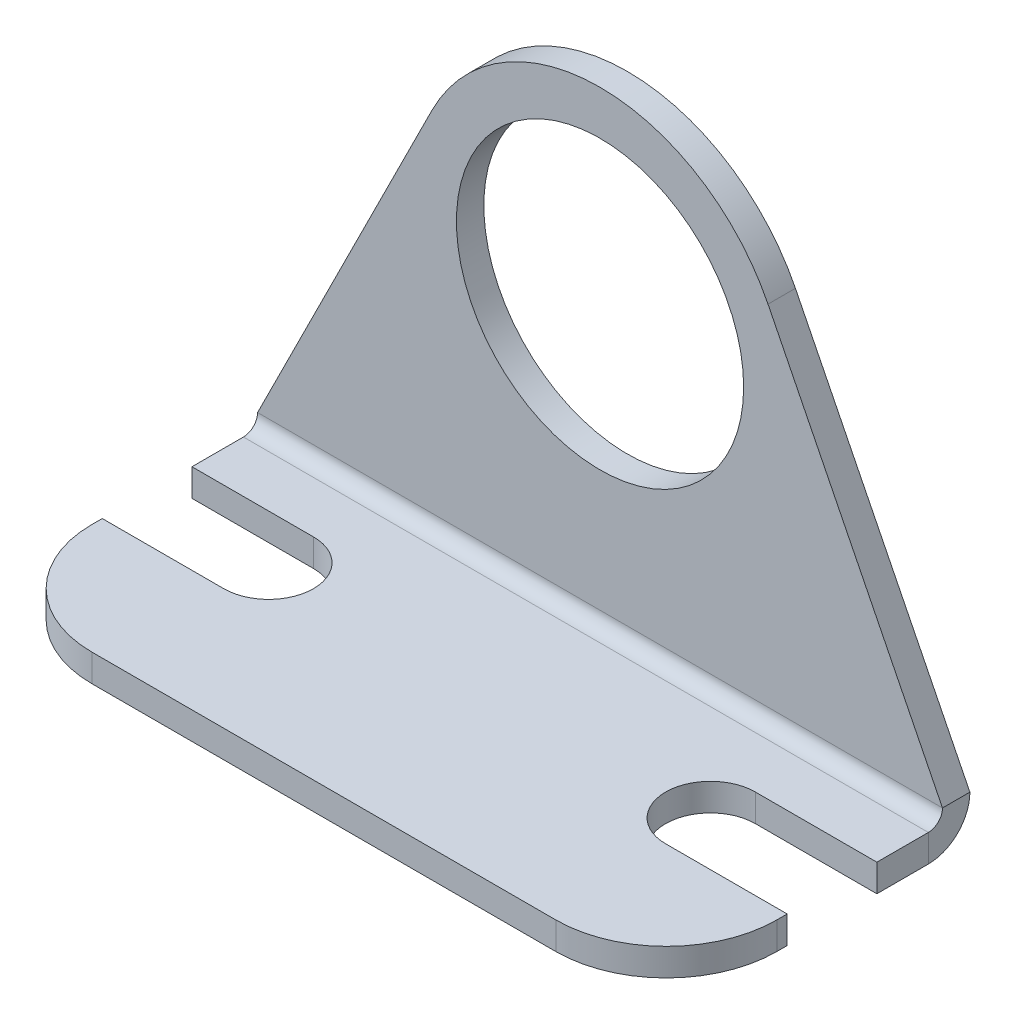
ISO-10303-21;
HEADER;
FILE_DESCRIPTION(('STEP AP214'),'2;1');
FILE_NAME('part.step','',(''),(''),'','','');
FILE_SCHEMA(('AUTOMOTIVE_DESIGN { 1 0 10303 214 1 1 1 1 }'));
ENDSEC;
DATA;
#1=APPLICATION_CONTEXT('core data for automotive mechanical design processes');
#2=APPLICATION_PROTOCOL_DEFINITION('international standard','automotive_design',2000,#1);
#3=PRODUCT_CONTEXT('',#1,'mechanical');
#4=PRODUCT('Part','Part','',(#3));
#5=PRODUCT_RELATED_PRODUCT_CATEGORY('part','',(#4));
#6=PRODUCT_DEFINITION_FORMATION('','',#4);
#7=PRODUCT_DEFINITION_CONTEXT('part definition',#1,'design');
#8=PRODUCT_DEFINITION('design','',#6,#7);
#9=PRODUCT_DEFINITION_SHAPE('','',#8);
#10=(LENGTH_UNIT() NAMED_UNIT(*) SI_UNIT(.MILLI.,.METRE.));
#11=(NAMED_UNIT(*) PLANE_ANGLE_UNIT() SI_UNIT($,.RADIAN.));
#12=(NAMED_UNIT(*) SI_UNIT($,.STERADIAN.) SOLID_ANGLE_UNIT());
#13=UNCERTAINTY_MEASURE_WITH_UNIT(LENGTH_MEASURE(1.E-05),#10,'distance_accuracy_value','');
#14=(GEOMETRIC_REPRESENTATION_CONTEXT(3) GLOBAL_UNCERTAINTY_ASSIGNED_CONTEXT((#13)) GLOBAL_UNIT_ASSIGNED_CONTEXT((#10,
#11,#12)) REPRESENTATION_CONTEXT('',''));
#15=CARTESIAN_POINT('',(0.,0.,0.));
#16=DIRECTION('',(0.,0.,1.));
#17=DIRECTION('',(1.,0.,0.));
#18=AXIS2_PLACEMENT_3D('',#15,#16,#17);
#19=CARTESIAN_POINT('',(19.685,-17.6276,17.4498));
#20=DIRECTION('',(-1.,0.,0.));
#21=DIRECTION('',(0.,0.,1.));
#22=AXIS2_PLACEMENT_3D('',#19,#20,#21);
#23=PLANE('',#22);
#24=DIRECTION('',(0.,0.,1.));
#25=VECTOR('',#24,1.);
#26=CARTESIAN_POINT('',(19.685,-17.6276,17.4498));
#27=LINE('',#26,#25);
#28=CARTESIAN_POINT('',(19.685,-17.6276000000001,10.5028999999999));
#29=VERTEX_POINT('',#28);
#30=CARTESIAN_POINT('',(19.685,-17.6276,11.0998));
#31=VERTEX_POINT('',#30);
#32=EDGE_CURVE('E210',#29,#31,#27,.T.);
#33=ORIENTED_EDGE('',*,*,#32,.F.);
#34=DIRECTION('',(0.,1.,0.));
#35=VECTOR('',#34,1.);
#36=CARTESIAN_POINT('',(19.685,-17.6276000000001,10.5028999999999));
#37=LINE('',#36,#35);
#38=CARTESIAN_POINT('',(19.685,-16.0528,10.5028999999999));
#39=VERTEX_POINT('',#38);
#40=EDGE_CURVE('E342',#29,#39,#37,.T.);
#41=ORIENTED_EDGE('',*,*,#40,.T.);
#42=DIRECTION('',(0.,0.,-1.));
#43=VECTOR('',#42,1.);
#44=CARTESIAN_POINT('',(19.685,-16.0528,17.4498));
#45=LINE('',#44,#43);
#46=CARTESIAN_POINT('',(19.685,-16.0528,11.0998));
#47=VERTEX_POINT('',#46);
#48=EDGE_CURVE('E225',#39,#47,#45,.F.);
#49=ORIENTED_EDGE('',*,*,#48,.T.);
#50=DIRECTION('',(0.,1.,0.));
#51=VECTOR('',#50,1.);
#52=CARTESIAN_POINT('',(19.685,-17.6276,11.0998));
#53=LINE('',#52,#51);
#54=EDGE_CURVE('E296',#47,#31,#53,.F.);
#55=ORIENTED_EDGE('',*,*,#54,.T.);
#56=EDGE_LOOP('',(#33,#41,#49,#55));
#57=FACE_BOUND('',#56,.T.);
#58=ADVANCED_FACE('F60',(#57),#23,.F.);
#59=CARTESIAN_POINT('',(-19.685,-17.6276,1.57479999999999));
#60=DIRECTION('',(1.,0.,0.));
#61=DIRECTION('',(0.,1.,0.));
#62=AXIS2_PLACEMENT_3D('',#59,#60,#61);
#63=PLANE('',#62);
#64=DIRECTION('',(0.,0.,-1.));
#65=VECTOR('',#64,1.);
#66=CARTESIAN_POINT('',(-19.685,-17.6276,17.4498));
#67=LINE('',#66,#65);
#68=CARTESIAN_POINT('',(-19.685,-17.6276000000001,5.34669999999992));
#69=VERTEX_POINT('',#68);
#70=CARTESIAN_POINT('',(-19.685,-17.6276,2.38759999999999));
#71=VERTEX_POINT('',#70);
#72=EDGE_CURVE('E220',#69,#71,#67,.T.);
#73=ORIENTED_EDGE('',*,*,#72,.F.);
#74=DIRECTION('',(0.,1.,0.));
#75=VECTOR('',#74,1.);
#76=CARTESIAN_POINT('',(-19.685,-17.6276000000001,5.34669999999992));
#77=LINE('',#76,#75);
#78=CARTESIAN_POINT('',(-19.685,-16.0528,5.34669999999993));
#79=VERTEX_POINT('',#78);
#80=EDGE_CURVE('E239',#69,#79,#77,.T.);
#81=ORIENTED_EDGE('',*,*,#80,.T.);
#82=DIRECTION('',(0.,0.,1.));
#83=VECTOR('',#82,1.);
#84=CARTESIAN_POINT('',(-19.685,-16.0528,1.5748));
#85=LINE('',#84,#83);
#86=CARTESIAN_POINT('',(-19.685,-16.0528,2.3876));
#87=VERTEX_POINT('',#86);
#88=EDGE_CURVE('E229',#79,#87,#85,.F.);
#89=ORIENTED_EDGE('',*,*,#88,.T.);
#90=DIRECTION('',(0.,1.,0.));
#91=VECTOR('',#90,1.);
#92=CARTESIAN_POINT('',(-19.685,-17.6276,2.38759999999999));
#93=LINE('',#92,#91);
#94=EDGE_CURVE('E236',#87,#71,#93,.F.);
#95=ORIENTED_EDGE('',*,*,#94,.T.);
#96=EDGE_LOOP('',(#73,#81,#89,#95));
#97=FACE_BOUND('',#96,.T.);
#98=ADVANCED_FACE('F367',(#97),#63,.F.);
#99=CARTESIAN_POINT('',(9.65614536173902,4.8260627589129,1.5748));
#100=DIRECTION('',(-0.894501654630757,-0.447064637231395,0.));
#101=DIRECTION('',(0.447064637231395,-0.894501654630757,0.));
#102=AXIS2_PLACEMENT_3D('',#99,#100,#101);
#103=PLANE('',#102);
#104=DIRECTION('',(-0.447064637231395,0.894501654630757,0.));
#105=VECTOR('',#104,1.);
#106=CARTESIAN_POINT('',(9.65614536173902,4.8260627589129,0.));
#107=LINE('',#106,#105);
#108=CARTESIAN_POINT('',(19.685,-15.24,0.));
#109=VERTEX_POINT('',#108);
#110=CARTESIAN_POINT('',(9.65614536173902,4.8260627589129,0.));
#111=VERTEX_POINT('',#110);
#112=EDGE_CURVE('E268',#109,#111,#107,.T.);
#113=ORIENTED_EDGE('',*,*,#112,.T.);
#114=DIRECTION('',(0.,0.,-1.));
#115=VECTOR('',#114,1.);
#116=CARTESIAN_POINT('',(9.65614536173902,4.8260627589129,1.5748));
#117=LINE('',#116,#115);
#118=CARTESIAN_POINT('',(9.65614536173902,4.8260627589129,1.5748));
#119=VERTEX_POINT('',#118);
#120=EDGE_CURVE('E281',#119,#111,#117,.T.);
#121=ORIENTED_EDGE('',*,*,#120,.F.);
#122=DIRECTION('',(-0.447064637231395,0.894501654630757,0.));
#123=VECTOR('',#122,1.);
#124=CARTESIAN_POINT('',(9.65614536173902,4.8260627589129,1.5748));
#125=LINE('',#124,#123);
#126=CARTESIAN_POINT('',(19.685,-15.24,1.5748));
#127=VERTEX_POINT('',#126);
#128=EDGE_CURVE('E255',#127,#119,#125,.T.);
#129=ORIENTED_EDGE('',*,*,#128,.F.);
#130=DIRECTION('',(0.,0.,-1.));
#131=VECTOR('',#130,1.);
#132=CARTESIAN_POINT('',(19.685,-15.24,1.5748));
#133=LINE('',#132,#131);
#134=EDGE_CURVE('E284',#127,#109,#133,.T.);
#135=ORIENTED_EDGE('',*,*,#134,.T.);
#136=EDGE_LOOP('',(#113,#121,#129,#135));
#137=FACE_BOUND('',#136,.T.);
#138=ADVANCED_FACE('F372',(#137),#103,.F.);
#139=CARTESIAN_POINT('',(0.,0.,1.5748));
#140=DIRECTION('',(0.,0.,-1.));
#141=DIRECTION('',(-1.,0.,0.));
#142=AXIS2_PLACEMENT_3D('',#139,#140,#141);
#143=CYLINDRICAL_SURFACE('',#142,10.795);
#144=CARTESIAN_POINT('',(0.,0.,0.));
#145=DIRECTION('',(0.,0.,1.));
#146=DIRECTION('',(1.,0.,0.));
#147=AXIS2_PLACEMENT_3D('',#144,#145,#146);
#148=CIRCLE('',#147,10.795);
#149=CARTESIAN_POINT('',(-9.65614536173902,4.8260627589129,0.));
#150=VERTEX_POINT('',#149);
#151=EDGE_CURVE('E270',#111,#150,#148,.T.);
#152=ORIENTED_EDGE('',*,*,#151,.T.);
#153=DIRECTION('',(0.,0.,-1.));
#154=VECTOR('',#153,1.);
#155=CARTESIAN_POINT('',(-9.65614536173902,4.8260627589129,1.5748));
#156=LINE('',#155,#154);
#157=CARTESIAN_POINT('',(-9.65614536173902,4.8260627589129,1.5748));
#158=VERTEX_POINT('',#157);
#159=EDGE_CURVE('E278',#158,#150,#156,.T.);
#160=ORIENTED_EDGE('',*,*,#159,.F.);
#161=CARTESIAN_POINT('',(0.,0.,1.5748));
#162=DIRECTION('',(0.,0.,1.));
#163=DIRECTION('',(1.,0.,0.));
#164=AXIS2_PLACEMENT_3D('',#161,#162,#163);
#165=CIRCLE('',#164,10.795);
#166=EDGE_CURVE('E258',#119,#158,#165,.T.);
#167=ORIENTED_EDGE('',*,*,#166,.F.);
#168=ORIENTED_EDGE('',*,*,#120,.T.);
#169=EDGE_LOOP('',(#152,#160,#167,#168));
#170=FACE_BOUND('',#169,.T.);
#171=ADVANCED_FACE('F416',(#170),#143,.T.);
#172=CARTESIAN_POINT('',(-9.65614536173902,4.8260627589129,1.5748));
#173=DIRECTION('',(0.894501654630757,-0.447064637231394,0.));
#174=DIRECTION('',(0.447064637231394,0.894501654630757,0.));
#175=AXIS2_PLACEMENT_3D('',#172,#173,#174);
#176=PLANE('',#175);
#177=DIRECTION('',(-0.447064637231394,-0.894501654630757,0.));
#178=VECTOR('',#177,1.);
#179=CARTESIAN_POINT('',(-9.65614536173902,4.8260627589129,0.));
#180=LINE('',#179,#178);
#181=CARTESIAN_POINT('',(-19.685,-15.24,0.));
#182=VERTEX_POINT('',#181);
#183=EDGE_CURVE('E272',#150,#182,#180,.T.);
#184=ORIENTED_EDGE('',*,*,#183,.T.);
#185=DIRECTION('',(0.,0.,-1.));
#186=VECTOR('',#185,1.);
#187=CARTESIAN_POINT('',(-19.685,-15.24,1.5748));
#188=LINE('',#187,#186);
#189=CARTESIAN_POINT('',(-19.685,-15.24,1.5748));
#190=VERTEX_POINT('',#189);
#191=EDGE_CURVE('E265',#190,#182,#188,.T.);
#192=ORIENTED_EDGE('',*,*,#191,.F.);
#193=DIRECTION('',(-0.447064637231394,-0.894501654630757,0.));
#194=VECTOR('',#193,1.);
#195=CARTESIAN_POINT('',(-9.65614536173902,4.8260627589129,1.5748));
#196=LINE('',#195,#194);
#197=EDGE_CURVE('E260',#158,#190,#196,.T.);
#198=ORIENTED_EDGE('',*,*,#197,.F.);
#199=ORIENTED_EDGE('',*,*,#159,.T.);
#200=EDGE_LOOP('',(#184,#192,#198,#199));
#201=FACE_BOUND('',#200,.T.);
#202=ADVANCED_FACE('F412',(#201),#176,.F.);
#203=CARTESIAN_POINT('',(0.,0.,1.5748));
#204=DIRECTION('',(0.,0.,-1.));
#205=DIRECTION('',(-1.,0.,0.));
#206=AXIS2_PLACEMENT_3D('',#203,#204,#205);
#207=CYLINDRICAL_SURFACE('',#206,8.255);
#208=CARTESIAN_POINT('',(0.,0.,1.5748));
#209=DIRECTION('',(0.,0.,1.));
#210=DIRECTION('',(1.,0.,0.));
#211=AXIS2_PLACEMENT_3D('',#208,#209,#210);
#212=CIRCLE('',#211,8.255);
#213=CARTESIAN_POINT('',(8.255,0.,1.5748));
#214=VERTEX_POINT('',#213);
#215=EDGE_CURVE('E262',#214,#214,#212,.T.);
#216=ORIENTED_EDGE('',*,*,#215,.T.);
#217=EDGE_LOOP('',(#216));
#218=FACE_BOUND('',#217,.T.);
#219=CARTESIAN_POINT('',(0.,0.,0.));
#220=DIRECTION('',(0.,0.,1.));
#221=DIRECTION('',(1.,0.,0.));
#222=AXIS2_PLACEMENT_3D('',#219,#220,#221);
#223=CIRCLE('',#222,8.255);
#224=CARTESIAN_POINT('',(8.255,0.,0.));
#225=VERTEX_POINT('',#224);
#226=EDGE_CURVE('E256',#225,#225,#223,.T.);
#227=ORIENTED_EDGE('',*,*,#226,.F.);
#228=EDGE_LOOP('',(#227));
#229=FACE_BOUND('',#228,.T.);
#230=ADVANCED_FACE('F405',(#218,#229),#207,.F.);
#231=CARTESIAN_POINT('',(0.,0.,1.5748));
#232=DIRECTION('',(0.,0.,1.));
#233=DIRECTION('',(1.,0.,0.));
#234=AXIS2_PLACEMENT_3D('',#231,#232,#233);
#235=PLANE('',#234);
#236=DIRECTION('',(1.,0.,0.));
#237=VECTOR('',#236,1.);
#238=CARTESIAN_POINT('',(0.,-15.24,1.5748));
#239=LINE('',#238,#237);
#240=EDGE_CURVE('E252',#190,#127,#239,.T.);
#241=ORIENTED_EDGE('',*,*,#240,.T.);
#242=ORIENTED_EDGE('',*,*,#128,.T.);
#243=ORIENTED_EDGE('',*,*,#166,.T.);
#244=ORIENTED_EDGE('',*,*,#197,.T.);
#245=EDGE_LOOP('',(#241,#242,#243,#244));
#246=FACE_BOUND('',#245,.T.);
#247=ORIENTED_EDGE('',*,*,#215,.F.);
#248=EDGE_LOOP('',(#247));
#249=FACE_BOUND('',#248,.T.);
#250=ADVANCED_FACE('F402',(#246,#249),#235,.T.);
#251=CARTESIAN_POINT('',(0.,0.,0.));
#252=DIRECTION('',(0.,0.,1.));
#253=DIRECTION('',(1.,0.,0.));
#254=AXIS2_PLACEMENT_3D('',#251,#252,#253);
#255=PLANE('',#254);
#256=DIRECTION('',(1.,0.,0.));
#257=VECTOR('',#256,1.);
#258=CARTESIAN_POINT('',(0.,-15.24,0.));
#259=LINE('',#258,#257);
#260=EDGE_CURVE('E243',#182,#109,#259,.T.);
#261=ORIENTED_EDGE('',*,*,#260,.F.);
#262=ORIENTED_EDGE('',*,*,#183,.F.);
#263=ORIENTED_EDGE('',*,*,#151,.F.);
#264=ORIENTED_EDGE('',*,*,#112,.F.);
#265=EDGE_LOOP('',(#261,#262,#263,#264));
#266=FACE_BOUND('',#265,.T.);
#267=ORIENTED_EDGE('',*,*,#226,.T.);
#268=EDGE_LOOP('',(#267));
#269=FACE_BOUND('',#268,.T.);
#270=ADVANCED_FACE('F397',(#266,#269),#255,.F.);
#271=CARTESIAN_POINT('',(-19.685,-15.24,2.3876));
#272=DIRECTION('',(-1.,0.,0.));
#273=DIRECTION('',(0.,0.,1.));
#274=AXIS2_PLACEMENT_3D('',#271,#272,#273);
#275=PLANE('',#274);
#276=ORIENTED_EDGE('',*,*,#94,.F.);
#277=CARTESIAN_POINT('',(-19.685,-15.24,2.3876));
#278=DIRECTION('',(1.,0.,0.));
#279=DIRECTION('',(0.,0.,-1.));
#280=AXIS2_PLACEMENT_3D('',#277,#278,#279);
#281=CIRCLE('',#280,0.812799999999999);
#282=EDGE_CURVE('E247',#190,#87,#281,.F.);
#283=ORIENTED_EDGE('',*,*,#282,.F.);
#284=ORIENTED_EDGE('',*,*,#191,.T.);
#285=CARTESIAN_POINT('',(-19.685,-15.24,2.3876));
#286=DIRECTION('',(1.,0.,0.));
#287=DIRECTION('',(0.,0.,-1.));
#288=AXIS2_PLACEMENT_3D('',#285,#286,#287);
#289=CIRCLE('',#288,2.3876);
#290=EDGE_CURVE('E240',#182,#71,#289,.F.);
#291=ORIENTED_EDGE('',*,*,#290,.T.);
#292=EDGE_LOOP('',(#276,#283,#284,#291));
#293=FACE_BOUND('',#292,.T.);
#294=ADVANCED_FACE('F394',(#293),#275,.T.);
#295=CARTESIAN_POINT('',(19.685,-15.24,2.3876));
#296=DIRECTION('',(-1.,0.,0.));
#297=DIRECTION('',(0.,0.,1.));
#298=AXIS2_PLACEMENT_3D('',#295,#296,#297);
#299=PLANE('',#298);
#300=CARTESIAN_POINT('',(19.685,-15.24,2.3876));
#301=DIRECTION('',(1.,0.,0.));
#302=DIRECTION('',(0.,0.,-1.));
#303=AXIS2_PLACEMENT_3D('',#300,#301,#302);
#304=CIRCLE('',#303,0.812799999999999);
#305=CARTESIAN_POINT('',(19.685,-16.0528,2.3876));
#306=VERTEX_POINT('',#305);
#307=EDGE_CURVE('E213',#306,#127,#304,.T.);
#308=ORIENTED_EDGE('',*,*,#307,.F.);
#309=DIRECTION('',(0.,1.,0.));
#310=VECTOR('',#309,1.);
#311=CARTESIAN_POINT('',(19.685,-16.0528,2.3876));
#312=LINE('',#311,#310);
#313=CARTESIAN_POINT('',(19.685,-17.6276,2.38759999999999));
#314=VERTEX_POINT('',#313);
#315=EDGE_CURVE('E231',#306,#314,#312,.F.);
#316=ORIENTED_EDGE('',*,*,#315,.T.);
#317=CARTESIAN_POINT('',(19.685,-15.24,2.3876));
#318=DIRECTION('',(1.,0.,0.));
#319=DIRECTION('',(0.,0.,-1.));
#320=AXIS2_PLACEMENT_3D('',#317,#318,#319);
#321=CIRCLE('',#320,2.3876);
#322=EDGE_CURVE('E244',#314,#109,#321,.T.);
#323=ORIENTED_EDGE('',*,*,#322,.T.);
#324=ORIENTED_EDGE('',*,*,#134,.F.);
#325=EDGE_LOOP('',(#308,#316,#323,#324));
#326=FACE_BOUND('',#325,.T.);
#327=ADVANCED_FACE('F391',(#326),#299,.F.);
#328=CARTESIAN_POINT('',(19.685,-15.24,2.3876));
#329=DIRECTION('',(1.,0.,0.));
#330=DIRECTION('',(0.,-1.,0.));
#331=AXIS2_PLACEMENT_3D('',#328,#329,#330);
#332=CYLINDRICAL_SURFACE('',#331,2.3876);
#333=ORIENTED_EDGE('',*,*,#260,.T.);
#334=ORIENTED_EDGE('',*,*,#322,.F.);
#335=DIRECTION('',(1.,0.,0.));
#336=VECTOR('',#335,1.);
#337=CARTESIAN_POINT('',(-19.685,-17.6276,2.38759999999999));
#338=LINE('',#337,#336);
#339=EDGE_CURVE('E208',#314,#71,#338,.F.);
#340=ORIENTED_EDGE('',*,*,#339,.T.);
#341=ORIENTED_EDGE('',*,*,#290,.F.);
#342=EDGE_LOOP('',(#333,#334,#340,#341));
#343=FACE_BOUND('',#342,.T.);
#344=ADVANCED_FACE('F386',(#343),#332,.T.);
#345=CARTESIAN_POINT('',(19.685,-15.24,2.3876));
#346=DIRECTION('',(1.,0.,0.));
#347=DIRECTION('',(0.,-1.,0.));
#348=AXIS2_PLACEMENT_3D('',#345,#346,#347);
#349=CYLINDRICAL_SURFACE('',#348,0.812799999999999);
#350=ORIENTED_EDGE('',*,*,#240,.F.);
#351=ORIENTED_EDGE('',*,*,#282,.T.);
#352=DIRECTION('',(1.,0.,0.));
#353=VECTOR('',#352,1.);
#354=CARTESIAN_POINT('',(-19.685,-16.0528,2.3876));
#355=LINE('',#354,#353);
#356=EDGE_CURVE('E234',#87,#306,#355,.T.);
#357=ORIENTED_EDGE('',*,*,#356,.T.);
#358=ORIENTED_EDGE('',*,*,#307,.T.);
#359=EDGE_LOOP('',(#350,#351,#357,#358));
#360=FACE_BOUND('',#359,.T.);
#361=ADVANCED_FACE('F382',(#360),#349,.F.);
#362=CARTESIAN_POINT('',(-19.685,-16.0528,11.0998));
#363=VERTEX_POINT('',#362);
#364=CARTESIAN_POINT('',(-19.685,-16.0528,10.5028999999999));
#365=VERTEX_POINT('',#364);
#366=EDGE_CURVE('E226',#363,#365,#85,.F.);
#367=ORIENTED_EDGE('',*,*,#366,.T.);
#368=DIRECTION('',(0.,1.,0.));
#369=VECTOR('',#368,1.);
#370=CARTESIAN_POINT('',(-19.685,-17.6276000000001,10.5028999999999));
#371=LINE('',#370,#369);
#372=CARTESIAN_POINT('',(-19.685,-17.6276000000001,10.5028999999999));
#373=VERTEX_POINT('',#372);
#374=EDGE_CURVE('E83',#373,#365,#371,.T.);
#375=ORIENTED_EDGE('',*,*,#374,.F.);
#376=CARTESIAN_POINT('',(-19.685,-17.6276,11.0998));
#377=VERTEX_POINT('',#376);
#378=EDGE_CURVE('E215',#377,#373,#67,.T.);
#379=ORIENTED_EDGE('',*,*,#378,.F.);
#380=DIRECTION('',(0.,1.,0.));
#381=VECTOR('',#380,1.);
#382=CARTESIAN_POINT('',(-19.685,-17.6276,11.0998));
#383=LINE('',#382,#381);
#384=EDGE_CURVE('E13',#377,#363,#383,.T.);
#385=ORIENTED_EDGE('',*,*,#384,.T.);
#386=EDGE_LOOP('',(#367,#375,#379,#385));
#387=FACE_BOUND('',#386,.T.);
#388=ADVANCED_FACE('F323',(#387),#63,.F.);
#389=CARTESIAN_POINT('',(19.685,-16.0528,5.34669999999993));
#390=VERTEX_POINT('',#389);
#391=EDGE_CURVE('E202',#306,#390,#45,.F.);
#392=ORIENTED_EDGE('',*,*,#391,.T.);
#393=DIRECTION('',(0.,1.,0.));
#394=VECTOR('',#393,1.);
#395=CARTESIAN_POINT('',(19.685,-17.6276000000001,5.34669999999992));
#396=LINE('',#395,#394);
#397=CARTESIAN_POINT('',(19.685,-17.6276000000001,5.34669999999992));
#398=VERTEX_POINT('',#397);
#399=EDGE_CURVE('E75',#398,#390,#396,.T.);
#400=ORIENTED_EDGE('',*,*,#399,.F.);
#401=EDGE_CURVE('E200',#314,#398,#27,.T.);
#402=ORIENTED_EDGE('',*,*,#401,.F.);
#403=ORIENTED_EDGE('',*,*,#315,.F.);
#404=EDGE_LOOP('',(#392,#400,#402,#403));
#405=FACE_BOUND('',#404,.T.);
#406=ADVANCED_FACE('F198',(#405),#23,.F.);
#407=CARTESIAN_POINT('',(-19.685,-17.6276,17.4498));
#408=DIRECTION('',(0.,1.,0.));
#409=DIRECTION('',(0.,0.,1.));
#410=AXIS2_PLACEMENT_3D('',#407,#408,#409);
#411=PLANE('',#410);
#412=CARTESIAN_POINT('',(12.7,-17.6276000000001,7.92479999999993));
#413=DIRECTION('',(0.,1.,0.));
#414=DIRECTION('',(0.,0.,1.));
#415=AXIS2_PLACEMENT_3D('',#412,#413,#414);
#416=CIRCLE('',#415,2.5781);
#417=CARTESIAN_POINT('',(12.7,-17.6276000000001,5.34669999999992));
#418=VERTEX_POINT('',#417);
#419=CARTESIAN_POINT('',(12.7,-17.6276000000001,10.5028999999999));
#420=VERTEX_POINT('',#419);
#421=EDGE_CURVE('E192',#418,#420,#416,.T.);
#422=ORIENTED_EDGE('',*,*,#421,.T.);
#423=DIRECTION('',(1.,0.,0.));
#424=VECTOR('',#423,1.);
#425=CARTESIAN_POINT('',(19.685,-17.6276000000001,10.5028999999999));
#426=LINE('',#425,#424);
#427=EDGE_CURVE('E203',#420,#29,#426,.T.);
#428=ORIENTED_EDGE('',*,*,#427,.T.);
#429=ORIENTED_EDGE('',*,*,#32,.T.);
#430=CARTESIAN_POINT('',(13.335,-17.6276,11.0998));
#431=DIRECTION('',(0.,1.,0.));
#432=DIRECTION('',(0.,0.,1.));
#433=AXIS2_PLACEMENT_3D('',#430,#431,#432);
#434=CIRCLE('',#433,6.35);
#435=CARTESIAN_POINT('',(13.335,-17.6276,17.4498));
#436=VERTEX_POINT('',#435);
#437=EDGE_CURVE('E68',#31,#436,#434,.F.);
#438=ORIENTED_EDGE('',*,*,#437,.T.);
#439=DIRECTION('',(-1.,0.,0.));
#440=VECTOR('',#439,1.);
#441=CARTESIAN_POINT('',(-19.685,-17.6276,17.4498));
#442=LINE('',#441,#440);
#443=CARTESIAN_POINT('',(-13.335,-17.6276,17.4498));
#444=VERTEX_POINT('',#443);
#445=EDGE_CURVE('E209',#436,#444,#442,.T.);
#446=ORIENTED_EDGE('',*,*,#445,.T.);
#447=CARTESIAN_POINT('',(-13.335,-17.6276,11.0998));
#448=DIRECTION('',(0.,1.,0.));
#449=DIRECTION('',(0.,0.,1.));
#450=AXIS2_PLACEMENT_3D('',#447,#448,#449);
#451=CIRCLE('',#450,6.35);
#452=EDGE_CURVE('E299',#444,#377,#451,.F.);
#453=ORIENTED_EDGE('',*,*,#452,.T.);
#454=ORIENTED_EDGE('',*,*,#378,.T.);
#455=DIRECTION('',(1.,0.,0.));
#456=VECTOR('',#455,1.);
#457=CARTESIAN_POINT('',(-19.685,-17.6276000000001,10.5028999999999));
#458=LINE('',#457,#456);
#459=CARTESIAN_POINT('',(-12.7,-17.6276000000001,10.5028999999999));
#460=VERTEX_POINT('',#459);
#461=EDGE_CURVE('E337',#373,#460,#458,.T.);
#462=ORIENTED_EDGE('',*,*,#461,.T.);
#463=CARTESIAN_POINT('',(-12.7,-17.6276000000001,7.92479999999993));
#464=DIRECTION('',(0.,1.,0.));
#465=DIRECTION('',(0.,0.,1.));
#466=AXIS2_PLACEMENT_3D('',#463,#464,#465);
#467=CIRCLE('',#466,2.5781);
#468=CARTESIAN_POINT('',(-12.7,-17.6276000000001,5.34669999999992));
#469=VERTEX_POINT('',#468);
#470=EDGE_CURVE('E329',#460,#469,#467,.T.);
#471=ORIENTED_EDGE('',*,*,#470,.T.);
#472=DIRECTION('',(-1.,0.,0.));
#473=VECTOR('',#472,1.);
#474=CARTESIAN_POINT('',(-19.685,-17.6276000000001,5.34669999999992));
#475=LINE('',#474,#473);
#476=EDGE_CURVE('E325',#469,#69,#475,.T.);
#477=ORIENTED_EDGE('',*,*,#476,.T.);
#478=ORIENTED_EDGE('',*,*,#72,.T.);
#479=ORIENTED_EDGE('',*,*,#339,.F.);
#480=ORIENTED_EDGE('',*,*,#401,.T.);
#481=DIRECTION('',(-1.,0.,0.));
#482=VECTOR('',#481,1.);
#483=CARTESIAN_POINT('',(19.685,-17.6276000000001,5.34669999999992));
#484=LINE('',#483,#482);
#485=EDGE_CURVE('E185',#398,#418,#484,.T.);
#486=ORIENTED_EDGE('',*,*,#485,.T.);
#487=EDGE_LOOP('',(#422,#428,#429,#438,#446,#453,#454,#462,#471,#477,#478,#479,#480,#486));
#488=FACE_BOUND('',#487,.T.);
#489=ADVANCED_FACE('F206',(#488),#411,.F.);
#490=CARTESIAN_POINT('',(-19.685,-16.0528,17.4498));
#491=DIRECTION('',(0.,1.,0.));
#492=DIRECTION('',(0.,0.,1.));
#493=AXIS2_PLACEMENT_3D('',#490,#491,#492);
#494=PLANE('',#493);
#495=DIRECTION('',(1.,0.,0.));
#496=VECTOR('',#495,1.);
#497=CARTESIAN_POINT('',(19.685,-16.0528,10.5028999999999));
#498=LINE('',#497,#496);
#499=CARTESIAN_POINT('',(12.7,-16.0528,10.5028999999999));
#500=VERTEX_POINT('',#499);
#501=EDGE_CURVE('E193',#500,#39,#498,.T.);
#502=ORIENTED_EDGE('',*,*,#501,.F.);
#503=CARTESIAN_POINT('',(12.7,-16.0528,7.92479999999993));
#504=DIRECTION('',(0.,1.,0.));
#505=DIRECTION('',(0.,0.,1.));
#506=AXIS2_PLACEMENT_3D('',#503,#504,#505);
#507=CIRCLE('',#506,2.5781);
#508=CARTESIAN_POINT('',(12.7,-16.0528,5.34669999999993));
#509=VERTEX_POINT('',#508);
#510=EDGE_CURVE('E353',#509,#500,#507,.T.);
#511=ORIENTED_EDGE('',*,*,#510,.F.);
#512=DIRECTION('',(-1.,0.,0.));
#513=VECTOR('',#512,1.);
#514=CARTESIAN_POINT('',(19.685,-16.0528,5.34669999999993));
#515=LINE('',#514,#513);
#516=EDGE_CURVE('E356',#390,#509,#515,.T.);
#517=ORIENTED_EDGE('',*,*,#516,.F.);
#518=ORIENTED_EDGE('',*,*,#391,.F.);
#519=ORIENTED_EDGE('',*,*,#356,.F.);
#520=ORIENTED_EDGE('',*,*,#88,.F.);
#521=DIRECTION('',(-1.,0.,0.));
#522=VECTOR('',#521,1.);
#523=CARTESIAN_POINT('',(-19.685,-16.0528,5.34669999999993));
#524=LINE('',#523,#522);
#525=CARTESIAN_POINT('',(-12.7,-16.0528,5.34669999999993));
#526=VERTEX_POINT('',#525);
#527=EDGE_CURVE('E335',#526,#79,#524,.T.);
#528=ORIENTED_EDGE('',*,*,#527,.F.);
#529=CARTESIAN_POINT('',(-12.7,-16.0528,7.92479999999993));
#530=DIRECTION('',(0.,1.,0.));
#531=DIRECTION('',(0.,0.,1.));
#532=AXIS2_PLACEMENT_3D('',#529,#530,#531);
#533=CIRCLE('',#532,2.5781);
#534=CARTESIAN_POINT('',(-12.7,-16.0528,10.5028999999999));
#535=VERTEX_POINT('',#534);
#536=EDGE_CURVE('E338',#535,#526,#533,.T.);
#537=ORIENTED_EDGE('',*,*,#536,.F.);
#538=DIRECTION('',(1.,0.,0.));
#539=VECTOR('',#538,1.);
#540=CARTESIAN_POINT('',(-19.685,-16.0528,10.5028999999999));
#541=LINE('',#540,#539);
#542=EDGE_CURVE('E341',#365,#535,#541,.T.);
#543=ORIENTED_EDGE('',*,*,#542,.F.);
#544=ORIENTED_EDGE('',*,*,#366,.F.);
#545=CARTESIAN_POINT('',(-13.335,-16.0528,11.0998));
#546=DIRECTION('',(0.,1.,0.));
#547=DIRECTION('',(0.,0.,1.));
#548=AXIS2_PLACEMENT_3D('',#545,#546,#547);
#549=CIRCLE('',#548,6.35);
#550=CARTESIAN_POINT('',(-13.335,-16.0528,17.4498));
#551=VERTEX_POINT('',#550);
#552=EDGE_CURVE('E291',#363,#551,#549,.T.);
#553=ORIENTED_EDGE('',*,*,#552,.T.);
#554=DIRECTION('',(1.,0.,0.));
#555=VECTOR('',#554,1.);
#556=CARTESIAN_POINT('',(-19.685,-16.0528,17.4498));
#557=LINE('',#556,#555);
#558=CARTESIAN_POINT('',(13.335,-16.0528,17.4498));
#559=VERTEX_POINT('',#558);
#560=EDGE_CURVE('E221',#559,#551,#557,.F.);
#561=ORIENTED_EDGE('',*,*,#560,.F.);
#562=CARTESIAN_POINT('',(13.335,-16.0528,11.0998));
#563=DIRECTION('',(0.,1.,0.));
#564=DIRECTION('',(0.,0.,1.));
#565=AXIS2_PLACEMENT_3D('',#562,#563,#564);
#566=CIRCLE('',#565,6.35);
#567=EDGE_CURVE('E293',#559,#47,#566,.T.);
#568=ORIENTED_EDGE('',*,*,#567,.T.);
#569=ORIENTED_EDGE('',*,*,#48,.F.);
#570=EDGE_LOOP('',(#502,#511,#517,#518,#519,#520,#528,#537,#543,#544,#553,#561,#568,#569));
#571=FACE_BOUND('',#570,.T.);
#572=ADVANCED_FACE('F316',(#571),#494,.T.);
#573=CARTESIAN_POINT('',(-19.685,-17.6276,17.4498));
#574=DIRECTION('',(0.,0.,-1.));
#575=DIRECTION('',(0.,1.,0.));
#576=AXIS2_PLACEMENT_3D('',#573,#574,#575);
#577=PLANE('',#576);
#578=ORIENTED_EDGE('',*,*,#445,.F.);
#579=DIRECTION('',(0.,1.,0.));
#580=VECTOR('',#579,1.);
#581=CARTESIAN_POINT('',(13.335,-17.6276,17.4498));
#582=LINE('',#581,#580);
#583=EDGE_CURVE('E288',#436,#559,#582,.T.);
#584=ORIENTED_EDGE('',*,*,#583,.T.);
#585=ORIENTED_EDGE('',*,*,#560,.T.);
#586=DIRECTION('',(0.,1.,0.));
#587=VECTOR('',#586,1.);
#588=CARTESIAN_POINT('',(-13.335,-17.6276,17.4498));
#589=LINE('',#588,#587);
#590=EDGE_CURVE('E286',#551,#444,#589,.F.);
#591=ORIENTED_EDGE('',*,*,#590,.T.);
#592=EDGE_LOOP('',(#578,#584,#585,#591));
#593=FACE_BOUND('',#592,.T.);
#594=ADVANCED_FACE('F309',(#593),#577,.F.);
#595=CARTESIAN_POINT('',(13.335,-17.6276,11.0998));
#596=DIRECTION('',(0.,1.,0.));
#597=DIRECTION('',(0.,0.,1.));
#598=AXIS2_PLACEMENT_3D('',#595,#596,#597);
#599=CYLINDRICAL_SURFACE('',#598,6.35);
#600=ORIENTED_EDGE('',*,*,#437,.F.);
#601=ORIENTED_EDGE('',*,*,#54,.F.);
#602=ORIENTED_EDGE('',*,*,#567,.F.);
#603=ORIENTED_EDGE('',*,*,#583,.F.);
#604=EDGE_LOOP('',(#600,#601,#602,#603));
#605=FACE_BOUND('',#604,.T.);
#606=ADVANCED_FACE('F312',(#605),#599,.T.);
#607=CARTESIAN_POINT('',(-13.335,-17.6276,11.0998));
#608=DIRECTION('',(0.,1.,0.));
#609=DIRECTION('',(0.,0.,1.));
#610=AXIS2_PLACEMENT_3D('',#607,#608,#609);
#611=CYLINDRICAL_SURFACE('',#610,6.35);
#612=ORIENTED_EDGE('',*,*,#452,.F.);
#613=ORIENTED_EDGE('',*,*,#590,.F.);
#614=ORIENTED_EDGE('',*,*,#552,.F.);
#615=ORIENTED_EDGE('',*,*,#384,.F.);
#616=EDGE_LOOP('',(#612,#613,#614,#615));
#617=FACE_BOUND('',#616,.T.);
#618=ADVANCED_FACE('F62',(#617),#611,.T.);
#619=CARTESIAN_POINT('',(-19.685,-17.6276000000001,5.34669999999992));
#620=DIRECTION('',(0.,0.,-1.));
#621=DIRECTION('',(0.,1.,0.));
#622=AXIS2_PLACEMENT_3D('',#619,#620,#621);
#623=PLANE('',#622);
#624=ORIENTED_EDGE('',*,*,#527,.T.);
#625=ORIENTED_EDGE('',*,*,#80,.F.);
#626=ORIENTED_EDGE('',*,*,#476,.F.);
#627=DIRECTION('',(0.,1.,0.));
#628=VECTOR('',#627,1.);
#629=CARTESIAN_POINT('',(-12.7,-17.6276000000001,5.34669999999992));
#630=LINE('',#629,#628);
#631=EDGE_CURVE('E326',#469,#526,#630,.T.);
#632=ORIENTED_EDGE('',*,*,#631,.T.);
#633=EDGE_LOOP('',(#624,#625,#626,#632));
#634=FACE_BOUND('',#633,.T.);
#635=ADVANCED_FACE('F428',(#634),#623,.F.);
#636=CARTESIAN_POINT('',(-12.7,-17.6276000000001,7.92479999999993));
#637=DIRECTION('',(0.,1.,0.));
#638=DIRECTION('',(0.,0.,1.));
#639=AXIS2_PLACEMENT_3D('',#636,#637,#638);
#640=CYLINDRICAL_SURFACE('',#639,2.5781);
#641=ORIENTED_EDGE('',*,*,#536,.T.);
#642=ORIENTED_EDGE('',*,*,#631,.F.);
#643=ORIENTED_EDGE('',*,*,#470,.F.);
#644=DIRECTION('',(0.,1.,0.));
#645=VECTOR('',#644,1.);
#646=CARTESIAN_POINT('',(-12.7,-17.6276000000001,10.5028999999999));
#647=LINE('',#646,#645);
#648=EDGE_CURVE('E324',#460,#535,#647,.T.);
#649=ORIENTED_EDGE('',*,*,#648,.T.);
#650=EDGE_LOOP('',(#641,#642,#643,#649));
#651=FACE_BOUND('',#650,.T.);
#652=ADVANCED_FACE('F437',(#651),#640,.F.);
#653=CARTESIAN_POINT('',(-19.685,-17.6276000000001,10.5028999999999));
#654=DIRECTION('',(0.,0.,1.));
#655=DIRECTION('',(0.,-1.,0.));
#656=AXIS2_PLACEMENT_3D('',#653,#654,#655);
#657=PLANE('',#656);
#658=ORIENTED_EDGE('',*,*,#542,.T.);
#659=ORIENTED_EDGE('',*,*,#648,.F.);
#660=ORIENTED_EDGE('',*,*,#461,.F.);
#661=ORIENTED_EDGE('',*,*,#374,.T.);
#662=EDGE_LOOP('',(#658,#659,#660,#661));
#663=FACE_BOUND('',#662,.T.);
#664=ADVANCED_FACE('F434',(#663),#657,.F.);
#665=CARTESIAN_POINT('',(19.685,-17.6276000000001,10.5028999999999));
#666=DIRECTION('',(0.,0.,1.));
#667=DIRECTION('',(0.,-1.,0.));
#668=AXIS2_PLACEMENT_3D('',#665,#666,#667);
#669=PLANE('',#668);
#670=ORIENTED_EDGE('',*,*,#501,.T.);
#671=ORIENTED_EDGE('',*,*,#40,.F.);
#672=ORIENTED_EDGE('',*,*,#427,.F.);
#673=DIRECTION('',(0.,1.,0.));
#674=VECTOR('',#673,1.);
#675=CARTESIAN_POINT('',(12.7,-17.6276000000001,10.5028999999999));
#676=LINE('',#675,#674);
#677=EDGE_CURVE('E348',#420,#500,#676,.T.);
#678=ORIENTED_EDGE('',*,*,#677,.T.);
#679=EDGE_LOOP('',(#670,#671,#672,#678));
#680=FACE_BOUND('',#679,.T.);
#681=ADVANCED_FACE('F364',(#680),#669,.F.);
#682=CARTESIAN_POINT('',(12.7,-17.6276000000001,7.92479999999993));
#683=DIRECTION('',(0.,1.,0.));
#684=DIRECTION('',(0.,0.,1.));
#685=AXIS2_PLACEMENT_3D('',#682,#683,#684);
#686=CYLINDRICAL_SURFACE('',#685,2.5781);
#687=ORIENTED_EDGE('',*,*,#510,.T.);
#688=ORIENTED_EDGE('',*,*,#677,.F.);
#689=ORIENTED_EDGE('',*,*,#421,.F.);
#690=DIRECTION('',(0.,1.,0.));
#691=VECTOR('',#690,1.);
#692=CARTESIAN_POINT('',(12.7,-17.6276000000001,5.34669999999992));
#693=LINE('',#692,#691);
#694=EDGE_CURVE('E187',#418,#509,#693,.T.);
#695=ORIENTED_EDGE('',*,*,#694,.T.);
#696=EDGE_LOOP('',(#687,#688,#689,#695));
#697=FACE_BOUND('',#696,.T.);
#698=ADVANCED_FACE('F361',(#697),#686,.F.);
#699=CARTESIAN_POINT('',(19.685,-17.6276000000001,5.34669999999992));
#700=DIRECTION('',(0.,0.,-1.));
#701=DIRECTION('',(0.,1.,0.));
#702=AXIS2_PLACEMENT_3D('',#699,#700,#701);
#703=PLANE('',#702);
#704=ORIENTED_EDGE('',*,*,#516,.T.);
#705=ORIENTED_EDGE('',*,*,#694,.F.);
#706=ORIENTED_EDGE('',*,*,#485,.F.);
#707=ORIENTED_EDGE('',*,*,#399,.T.);
#708=EDGE_LOOP('',(#704,#705,#706,#707));
#709=FACE_BOUND('',#708,.T.);
#710=ADVANCED_FACE('F186',(#709),#703,.F.);
#711=CLOSED_SHELL('',(#58,#98,#138,#171,#202,#230,#250,#270,#294,#327,#344,#361,#388,#406,#489,
#572,#594,#606,#618,#635,#652,#664,#681,#698,#710));
#712=MANIFOLD_SOLID_BREP('B2',#711);
#713=ADVANCED_BREP_SHAPE_REPRESENTATION('',(#18,#712),#14);
#714=SHAPE_DEFINITION_REPRESENTATION(#9,#713);
ENDSEC;
END-ISO-10303-21;
